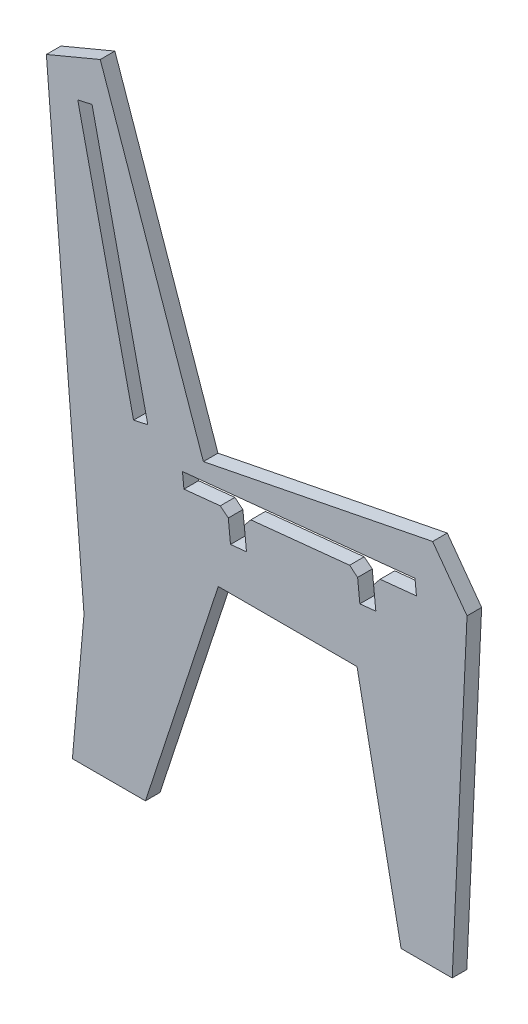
ISO-10303-21;
HEADER;
FILE_DESCRIPTION(('STEP AP214'),'2;1');
FILE_NAME('part.step','',(''),(''),'','','');
FILE_SCHEMA(('AUTOMOTIVE_DESIGN { 1 0 10303 214 1 1 1 1 }'));
ENDSEC;
DATA;
#1=APPLICATION_CONTEXT('core data for automotive mechanical design processes');
#2=APPLICATION_PROTOCOL_DEFINITION('international standard','automotive_design',2000,#1);
#3=PRODUCT_CONTEXT('',#1,'mechanical');
#4=PRODUCT('Part','Part','',(#3));
#5=PRODUCT_RELATED_PRODUCT_CATEGORY('part','',(#4));
#6=PRODUCT_DEFINITION_FORMATION('','',#4);
#7=PRODUCT_DEFINITION_CONTEXT('part definition',#1,'design');
#8=PRODUCT_DEFINITION('design','',#6,#7);
#9=PRODUCT_DEFINITION_SHAPE('','',#8);
#10=(LENGTH_UNIT() NAMED_UNIT(*) SI_UNIT(.MILLI.,.METRE.));
#11=(NAMED_UNIT(*) PLANE_ANGLE_UNIT() SI_UNIT($,.RADIAN.));
#12=(NAMED_UNIT(*) SI_UNIT($,.STERADIAN.) SOLID_ANGLE_UNIT());
#13=UNCERTAINTY_MEASURE_WITH_UNIT(LENGTH_MEASURE(1.E-05),#10,'distance_accuracy_value','');
#14=(GEOMETRIC_REPRESENTATION_CONTEXT(3) GLOBAL_UNCERTAINTY_ASSIGNED_CONTEXT((#13)) GLOBAL_UNIT_ASSIGNED_CONTEXT((#10,
#11,#12)) REPRESENTATION_CONTEXT('',''));
#15=CARTESIAN_POINT('',(0.,0.,0.));
#16=DIRECTION('',(0.,0.,1.));
#17=DIRECTION('',(1.,0.,0.));
#18=AXIS2_PLACEMENT_3D('',#15,#16,#17);
#19=CARTESIAN_POINT('',(152.712022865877,395.981549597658,20.));
#20=DIRECTION('',(-0.101741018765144,0.994810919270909,0.));
#21=DIRECTION('',(-0.994810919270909,-0.101741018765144,0.));
#22=AXIS2_PLACEMENT_3D('',#19,#20,#21);
#23=PLANE('',#22);
#24=DIRECTION('',(0.994810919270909,0.101741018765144,0.));
#25=VECTOR('',#24,1.);
#26=CARTESIAN_POINT('',(152.712022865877,395.981549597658,20.));
#27=LINE('',#26,#25);
#28=CARTESIAN_POINT('',(244.234627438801,405.341723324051,20.));
#29=VERTEX_POINT('',#28);
#30=CARTESIAN_POINT('',(379.528912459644,419.17850187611,20.));
#31=VERTEX_POINT('',#30);
#32=EDGE_CURVE('E308',#29,#31,#27,.T.);
#33=ORIENTED_EDGE('',*,*,#32,.T.);
#34=DIRECTION('',(0.,0.,-1.));
#35=VECTOR('',#34,1.);
#36=CARTESIAN_POINT('',(379.528912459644,419.17850187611,0.));
#37=LINE('',#36,#35);
#38=CARTESIAN_POINT('',(379.528912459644,419.17850187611,0.));
#39=VERTEX_POINT('',#38);
#40=EDGE_CURVE('E465',#31,#39,#37,.T.);
#41=ORIENTED_EDGE('',*,*,#40,.T.);
#42=DIRECTION('',(0.994810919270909,0.101741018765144,0.));
#43=VECTOR('',#42,1.);
#44=CARTESIAN_POINT('',(152.712022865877,395.981549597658,0.));
#45=LINE('',#44,#43);
#46=CARTESIAN_POINT('',(244.234627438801,405.341723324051,0.));
#47=VERTEX_POINT('',#46);
#48=EDGE_CURVE('E320',#47,#39,#45,.T.);
#49=ORIENTED_EDGE('',*,*,#48,.F.);
#50=DIRECTION('',(0.,0.,1.));
#51=VECTOR('',#50,1.);
#52=CARTESIAN_POINT('',(244.234627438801,405.341723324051,20.));
#53=LINE('',#52,#51);
#54=EDGE_CURVE('E462',#47,#29,#53,.T.);
#55=ORIENTED_EDGE('',*,*,#54,.T.);
#56=EDGE_LOOP('',(#33,#41,#49,#55));
#57=FACE_BOUND('',#56,.T.);
#58=ADVANCED_FACE('F33',(#57),#23,.T.);
#59=CARTESIAN_POINT('',(152.712022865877,395.981549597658,20.));
#60=VERTEX_POINT('',#59);
#61=CARTESIAN_POINT('',(202.452568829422,401.068600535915,20.));
#62=VERTEX_POINT('',#61);
#63=EDGE_CURVE('E304',#60,#62,#27,.T.);
#64=ORIENTED_EDGE('',*,*,#63,.T.);
#65=DIRECTION('',(0.,0.,-1.));
#66=VECTOR('',#65,1.);
#67=CARTESIAN_POINT('',(202.452568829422,401.068600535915,0.));
#68=LINE('',#67,#66);
#69=CARTESIAN_POINT('',(202.452568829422,401.068600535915,0.));
#70=VERTEX_POINT('',#69);
#71=EDGE_CURVE('E11',#62,#70,#68,.T.);
#72=ORIENTED_EDGE('',*,*,#71,.T.);
#73=CARTESIAN_POINT('',(152.712022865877,395.981549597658,0.));
#74=VERTEX_POINT('',#73);
#75=EDGE_CURVE('E317',#74,#70,#45,.T.);
#76=ORIENTED_EDGE('',*,*,#75,.F.);
#77=DIRECTION('',(0.,0.,-1.));
#78=VECTOR('',#77,1.);
#79=CARTESIAN_POINT('',(152.712022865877,395.981549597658,20.));
#80=LINE('',#79,#78);
#81=EDGE_CURVE('E332',#60,#74,#80,.T.);
#82=ORIENTED_EDGE('',*,*,#81,.F.);
#83=EDGE_LOOP('',(#64,#72,#76,#82));
#84=FACE_BOUND('',#83,.T.);
#85=ADVANCED_FACE('F539',(#84),#23,.T.);
#86=CARTESIAN_POINT('',(0.,0.,20.));
#87=DIRECTION('',(0.,0.,1.));
#88=DIRECTION('',(1.,0.,0.));
#89=AXIS2_PLACEMENT_3D('',#86,#87,#88);
#90=PLANE('',#89);
#91=DIRECTION('',(0.101741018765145,-0.994810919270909,0.));
#92=VECTOR('',#91,1.);
#93=CARTESIAN_POINT('',(389.477021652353,420.195912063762,20.));
#94=LINE('',#93,#92);
#95=CARTESIAN_POINT('',(390.494431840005,410.247802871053,20.));
#96=VERTEX_POINT('',#95);
#97=CARTESIAN_POINT('',(393.546662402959,380.403475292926,20.));
#98=VERTEX_POINT('',#97);
#99=EDGE_CURVE('E252',#96,#98,#94,.T.);
#100=ORIENTED_EDGE('',*,*,#99,.F.);
#101=DIRECTION('',(-0.775379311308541,0.631495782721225,0.));
#102=VECTOR('',#101,1.);
#103=CARTESIAN_POINT('',(356.601403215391,437.851459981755,20.));
#104=LINE('',#103,#102);
#105=EDGE_CURVE('E460',#96,#31,#104,.T.);
#106=ORIENTED_EDGE('',*,*,#105,.T.);
#107=ORIENTED_EDGE('',*,*,#32,.F.);
#108=DIRECTION('',(-0.631495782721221,-0.775379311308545,0.));
#109=VECTOR('',#108,1.);
#110=CARTESIAN_POINT('',(-51.6380225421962,42.0557951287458,20.));
#111=LINE('',#110,#109);
#112=CARTESIAN_POINT('',(235.303928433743,394.37620394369,20.));
#113=VERTEX_POINT('',#112);
#114=EDGE_CURVE('E456',#29,#113,#111,.T.);
#115=ORIENTED_EDGE('',*,*,#114,.T.);
#116=DIRECTION('',(-0.101741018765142,0.994810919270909,0.));
#117=VECTOR('',#116,1.);
#118=CARTESIAN_POINT('',(234.286518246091,404.324313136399,20.));
#119=LINE('',#118,#117);
#120=CARTESIAN_POINT('',(238.356158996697,364.531876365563,20.));
#121=VERTEX_POINT('',#120);
#122=EDGE_CURVE('E289',#121,#113,#119,.T.);
#123=ORIENTED_EDGE('',*,*,#122,.F.);
#124=DIRECTION('',(0.994810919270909,0.101741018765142,0.));
#125=VECTOR('',#124,1.);
#126=CARTESIAN_POINT('',(216.470318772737,362.29357395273,20.));
#127=LINE('',#126,#125);
#128=CARTESIAN_POINT('',(216.470318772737,362.29357395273,20.));
#129=VERTEX_POINT('',#128);
#130=EDGE_CURVE('E286',#129,#121,#127,.T.);
#131=ORIENTED_EDGE('',*,*,#130,.F.);
#132=DIRECTION('',(0.101741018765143,-0.994810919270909,0.));
#133=VECTOR('',#132,1.);
#134=CARTESIAN_POINT('',(212.400678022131,402.086010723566,20.));
#135=LINE('',#134,#133);
#136=CARTESIAN_POINT('',(213.418088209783,392.137901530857,20.));
#137=VERTEX_POINT('',#136);
#138=EDGE_CURVE('E284',#137,#129,#135,.T.);
#139=ORIENTED_EDGE('',*,*,#138,.F.);
#140=DIRECTION('',(-0.775379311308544,0.631495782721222,0.));
#141=VECTOR('',#140,1.);
#142=CARTESIAN_POINT('',(277.118182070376,340.258337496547,20.));
#143=LINE('',#142,#141);
#144=EDGE_CURVE('E454',#137,#62,#143,.T.);
#145=ORIENTED_EDGE('',*,*,#144,.T.);
#146=ORIENTED_EDGE('',*,*,#63,.F.);
#147=DIRECTION('',(0.101741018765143,-0.994810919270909,0.));
#148=VECTOR('',#147,1.);
#149=CARTESIAN_POINT('',(150.677202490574,415.877767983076,20.));
#150=LINE('',#149,#148);
#151=CARTESIAN_POINT('',(150.677202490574,415.877767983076,20.));
#152=VERTEX_POINT('',#151);
#153=EDGE_CURVE('E300',#152,#60,#150,.T.);
#154=ORIENTED_EDGE('',*,*,#153,.F.);
#155=DIRECTION('',(-0.994810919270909,-0.101741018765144,0.));
#156=VECTOR('',#155,1.);
#157=CARTESIAN_POINT('',(150.677202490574,415.877767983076,20.));
#158=LINE('',#157,#156);
#159=CARTESIAN_POINT('',(469.016696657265,448.434893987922,20.));
#160=VERTEX_POINT('',#159);
#161=EDGE_CURVE('E311',#160,#152,#158,.T.);
#162=ORIENTED_EDGE('',*,*,#161,.F.);
#163=DIRECTION('',(-0.101741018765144,0.994810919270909,0.));
#164=VECTOR('',#163,1.);
#165=CARTESIAN_POINT('',(469.016696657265,448.434893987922,20.));
#166=LINE('',#165,#164);
#167=CARTESIAN_POINT('',(471.051517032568,428.538675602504,20.));
#168=VERTEX_POINT('',#167);
#169=EDGE_CURVE('E307',#168,#160,#166,.T.);
#170=ORIENTED_EDGE('',*,*,#169,.F.);
#171=CARTESIAN_POINT('',(421.310971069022,423.451624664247,20.));
#172=VERTEX_POINT('',#171);
#173=EDGE_CURVE('E302',#172,#168,#27,.T.);
#174=ORIENTED_EDGE('',*,*,#173,.F.);
#175=DIRECTION('',(-0.631495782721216,-0.775379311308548,0.));
#176=VECTOR('',#175,1.);
#177=CARTESIAN_POINT('',(45.9550999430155,-37.427426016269,20.));
#178=LINE('',#177,#176);
#179=CARTESIAN_POINT('',(412.380272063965,412.486105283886,20.));
#180=VERTEX_POINT('',#179);
#181=EDGE_CURVE('E458',#172,#180,#178,.T.);
#182=ORIENTED_EDGE('',*,*,#181,.T.);
#183=DIRECTION('',(-0.101741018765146,0.994810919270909,0.));
#184=VECTOR('',#183,1.);
#185=CARTESIAN_POINT('',(411.362861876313,422.434214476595,20.));
#186=LINE('',#185,#184);
#187=CARTESIAN_POINT('',(415.432502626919,382.641777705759,20.));
#188=VERTEX_POINT('',#187);
#189=EDGE_CURVE('E257',#188,#180,#186,.T.);
#190=ORIENTED_EDGE('',*,*,#189,.F.);
#191=DIRECTION('',(0.994810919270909,0.101741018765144,0.));
#192=VECTOR('',#191,1.);
#193=CARTESIAN_POINT('',(393.546662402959,380.403475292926,20.));
#194=LINE('',#193,#192);
#195=EDGE_CURVE('E273',#98,#188,#194,.T.);
#196=ORIENTED_EDGE('',*,*,#195,.F.);
#197=EDGE_LOOP('',(#100,#106,#107,#115,#123,#131,#139,#145,#146,#154,#162,#170,#174,#182,#190,#196));
#198=FACE_BOUND('',#197,.T.);
#199=DIRECTION('',(0.218199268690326,-0.975904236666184,0.));
#200=VECTOR('',#199,1.);
#201=CARTESIAN_POINT('',(7.35353665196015,784.823616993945,20.));
#202=LINE('',#201,#200);
#203=CARTESIAN_POINT('',(7.35353665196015,784.823616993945,20.));
#204=VERTEX_POINT('',#203);
#205=CARTESIAN_POINT('',(83.7232806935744,443.257134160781,20.));
#206=VERTEX_POINT('',#205);
#207=EDGE_CURVE('E338',#204,#206,#202,.T.);
#208=ORIENTED_EDGE('',*,*,#207,.F.);
#209=DIRECTION('',(-0.975904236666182,-0.218199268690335,0.));
#210=VECTOR('',#209,1.);
#211=CARTESIAN_POINT('',(26.8716213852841,789.187602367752,20.));
#212=LINE('',#211,#210);
#213=CARTESIAN_POINT('',(26.8716213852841,789.187602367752,20.));
#214=VERTEX_POINT('',#213);
#215=EDGE_CURVE('E336',#214,#204,#212,.T.);
#216=ORIENTED_EDGE('',*,*,#215,.F.);
#217=DIRECTION('',(-0.218199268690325,0.975904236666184,0.));
#218=VECTOR('',#217,1.);
#219=CARTESIAN_POINT('',(26.8716213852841,789.187602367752,20.));
#220=LINE('',#219,#218);
#221=CARTESIAN_POINT('',(103.241365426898,447.621119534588,20.));
#222=VERTEX_POINT('',#221);
#223=EDGE_CURVE('E344',#222,#214,#220,.T.);
#224=ORIENTED_EDGE('',*,*,#223,.F.);
#225=DIRECTION('',(0.975904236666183,0.218199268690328,0.));
#226=VECTOR('',#225,1.);
#227=CARTESIAN_POINT('',(103.241365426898,447.621119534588,20.));
#228=LINE('',#227,#226);
#229=EDGE_CURVE('E341',#206,#222,#228,.T.);
#230=ORIENTED_EDGE('',*,*,#229,.F.);
#231=EDGE_LOOP('',(#208,#216,#224,#230));
#232=FACE_BOUND('',#231,.T.);
#233=DIRECTION('',(-0.0882487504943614,-0.996098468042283,0.));
#234=VECTOR('',#233,1.);
#235=CARTESIAN_POINT('',(15.8847750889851,179.297724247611,20.));
#236=LINE('',#235,#234);
#237=CARTESIAN_POINT('',(15.8847750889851,179.297724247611,20.));
#238=VERTEX_POINT('',#237);
#239=CARTESIAN_POINT('',(0.,0.,20.));
#240=VERTEX_POINT('',#239);
#241=EDGE_CURVE('E367',#238,#240,#236,.T.);
#242=ORIENTED_EDGE('',*,*,#241,.T.);
#243=DIRECTION('',(1.,0.,0.));
#244=VECTOR('',#243,1.);
#245=CARTESIAN_POINT('',(0.,0.,20.));
#246=LINE('',#245,#244);
#247=CARTESIAN_POINT('',(100.,0.,20.));
#248=VERTEX_POINT('',#247);
#249=EDGE_CURVE('E370',#240,#248,#246,.T.);
#250=ORIENTED_EDGE('',*,*,#249,.T.);
#251=DIRECTION('',(0.3115234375,0.950238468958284,0.));
#252=VECTOR('',#251,1.);
#253=CARTESIAN_POINT('',(100.,0.,20.));
#254=LINE('',#253,#252);
#255=CARTESIAN_POINT('',(199.6875,304.076310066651,20.));
#256=VERTEX_POINT('',#255);
#257=EDGE_CURVE('E373',#248,#256,#254,.T.);
#258=ORIENTED_EDGE('',*,*,#257,.T.);
#259=DIRECTION('',(1.,0.,0.));
#260=VECTOR('',#259,1.);
#261=CARTESIAN_POINT('',(199.6875,304.076310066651,20.));
#262=LINE('',#261,#260);
#263=CARTESIAN_POINT('',(389.6875,304.076310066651,20.));
#264=VERTEX_POINT('',#263);
#265=EDGE_CURVE('E375',#256,#264,#262,.T.);
#266=ORIENTED_EDGE('',*,*,#265,.T.);
#267=DIRECTION('',(0.194556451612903,-0.980891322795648,0.));
#268=VECTOR('',#267,1.);
#269=CARTESIAN_POINT('',(389.6875,304.076310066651,20.));
#270=LINE('',#269,#268);
#271=CARTESIAN_POINT('',(450.,0.,20.));
#272=VERTEX_POINT('',#271);
#273=EDGE_CURVE('E377',#264,#272,#270,.T.);
#274=ORIENTED_EDGE('',*,*,#273,.T.);
#275=DIRECTION('',(1.,0.,0.));
#276=VECTOR('',#275,1.);
#277=CARTESIAN_POINT('',(450.,0.,20.));
#278=LINE('',#277,#276);
#279=CARTESIAN_POINT('',(520.,0.,20.));
#280=VERTEX_POINT('',#279);
#281=EDGE_CURVE('E379',#272,#280,#278,.T.);
#282=ORIENTED_EDGE('',*,*,#281,.T.);
#283=DIRECTION('',(0.0461189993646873,0.998935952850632,0.));
#284=VECTOR('',#283,1.);
#285=CARTESIAN_POINT('',(520.,0.,20.));
#286=LINE('',#285,#284);
#287=CARTESIAN_POINT('',(540.292359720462,439.531819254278,20.));
#288=VERTEX_POINT('',#287);
#289=EDGE_CURVE('E381',#280,#288,#286,.T.);
#290=ORIENTED_EDGE('',*,*,#289,.T.);
#291=DIRECTION('',(-0.588583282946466,0.808436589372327,0.));
#292=VECTOR('',#291,1.);
#293=CARTESIAN_POINT('',(540.292359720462,439.531819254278,20.));
#294=LINE('',#293,#292);
#295=CARTESIAN_POINT('',(493.205697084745,504.206746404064,20.));
#296=VERTEX_POINT('',#295);
#297=EDGE_CURVE('E383',#288,#296,#294,.T.);
#298=ORIENTED_EDGE('',*,*,#297,.T.);
#299=DIRECTION('',(-0.980891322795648,-0.194556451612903,0.));
#300=VECTOR('',#299,1.);
#301=CARTESIAN_POINT('',(493.205697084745,504.206746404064,20.));
#302=LINE('',#301,#300);
#303=CARTESIAN_POINT('',(179.320473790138,441.948681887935,20.));
#304=VERTEX_POINT('',#303);
#305=EDGE_CURVE('E385',#296,#304,#302,.T.);
#306=ORIENTED_EDGE('',*,*,#305,.T.);
#307=DIRECTION('',(-0.328301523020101,0.944572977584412,0.));
#308=VECTOR('',#307,1.);
#309=CARTESIAN_POINT('',(179.320473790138,441.948681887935,20.));
#310=LINE('',#309,#308);
#311=CARTESIAN_POINT('',(38.1508188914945,848.115062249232,20.));
#312=VERTEX_POINT('',#311);
#313=EDGE_CURVE('E387',#304,#312,#310,.T.);
#314=ORIENTED_EDGE('',*,*,#313,.T.);
#315=DIRECTION('',(-0.922420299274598,-0.386187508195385,0.));
#316=VECTOR('',#315,1.);
#317=CARTESIAN_POINT('',(38.1508188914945,848.115062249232,20.));
#318=LINE('',#317,#316);
#319=CARTESIAN_POINT('',(-35.6428050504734,817.220061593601,20.));
#320=VERTEX_POINT('',#319);
#321=EDGE_CURVE('E389',#312,#320,#318,.T.);
#322=ORIENTED_EDGE('',*,*,#321,.T.);
#323=DIRECTION('',(0.0805118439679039,-0.99675365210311,0.));
#324=VECTOR('',#323,1.);
#325=CARTESIAN_POINT('',(-35.6428050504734,817.220061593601,20.));
#326=LINE('',#325,#324);
#327=EDGE_CURVE('E391',#320,#238,#326,.T.);
#328=ORIENTED_EDGE('',*,*,#327,.T.);
#329=EDGE_LOOP('',(#242,#250,#258,#266,#274,#282,#290,#298,#306,#314,#322,#328));
#330=FACE_BOUND('',#329,.T.);
#331=ADVANCED_FACE('F486',(#198,#232,#330),#90,.T.);
#332=CARTESIAN_POINT('',(0.,0.,0.));
#333=DIRECTION('',(0.,0.,1.));
#334=DIRECTION('',(1.,0.,0.));
#335=AXIS2_PLACEMENT_3D('',#332,#333,#334);
#336=PLANE('',#335);
#337=ORIENTED_EDGE('',*,*,#48,.T.);
#338=DIRECTION('',(0.775379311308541,-0.631495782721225,0.));
#339=VECTOR('',#338,1.);
#340=CARTESIAN_POINT('',(390.494431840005,410.247802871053,0.));
#341=LINE('',#340,#339);
#342=CARTESIAN_POINT('',(390.494431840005,410.247802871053,0.));
#343=VERTEX_POINT('',#342);
#344=EDGE_CURVE('E270',#39,#343,#341,.T.);
#345=ORIENTED_EDGE('',*,*,#344,.T.);
#346=DIRECTION('',(-0.101741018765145,0.994810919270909,0.));
#347=VECTOR('',#346,1.);
#348=CARTESIAN_POINT('',(389.477021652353,420.195912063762,0.));
#349=LINE('',#348,#347);
#350=CARTESIAN_POINT('',(393.546662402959,380.403475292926,0.));
#351=VERTEX_POINT('',#350);
#352=EDGE_CURVE('E249',#351,#343,#349,.T.);
#353=ORIENTED_EDGE('',*,*,#352,.F.);
#354=DIRECTION('',(-0.994810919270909,-0.101741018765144,0.));
#355=VECTOR('',#354,1.);
#356=CARTESIAN_POINT('',(393.546662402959,380.403475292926,0.));
#357=LINE('',#356,#355);
#358=CARTESIAN_POINT('',(415.432502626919,382.641777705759,0.));
#359=VERTEX_POINT('',#358);
#360=EDGE_CURVE('E261',#359,#351,#357,.T.);
#361=ORIENTED_EDGE('',*,*,#360,.F.);
#362=DIRECTION('',(0.101741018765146,-0.994810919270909,0.));
#363=VECTOR('',#362,1.);
#364=CARTESIAN_POINT('',(411.362861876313,422.434214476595,0.));
#365=LINE('',#364,#363);
#366=CARTESIAN_POINT('',(412.380272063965,412.486105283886,0.));
#367=VERTEX_POINT('',#366);
#368=EDGE_CURVE('E271',#367,#359,#365,.T.);
#369=ORIENTED_EDGE('',*,*,#368,.F.);
#370=DIRECTION('',(0.631495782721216,0.775379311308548,0.));
#371=VECTOR('',#370,1.);
#372=CARTESIAN_POINT('',(421.310971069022,423.451624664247,0.));
#373=LINE('',#372,#371);
#374=CARTESIAN_POINT('',(421.310971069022,423.451624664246,0.));
#375=VERTEX_POINT('',#374);
#376=EDGE_CURVE('E470',#367,#375,#373,.T.);
#377=ORIENTED_EDGE('',*,*,#376,.T.);
#378=CARTESIAN_POINT('',(471.051517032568,428.538675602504,0.));
#379=VERTEX_POINT('',#378);
#380=EDGE_CURVE('E316',#375,#379,#45,.T.);
#381=ORIENTED_EDGE('',*,*,#380,.T.);
#382=DIRECTION('',(-0.101741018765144,0.994810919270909,0.));
#383=VECTOR('',#382,1.);
#384=CARTESIAN_POINT('',(469.016696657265,448.434893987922,0.));
#385=LINE('',#384,#383);
#386=CARTESIAN_POINT('',(469.016696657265,448.434893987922,0.));
#387=VERTEX_POINT('',#386);
#388=EDGE_CURVE('E319',#379,#387,#385,.T.);
#389=ORIENTED_EDGE('',*,*,#388,.T.);
#390=DIRECTION('',(-0.994810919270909,-0.101741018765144,0.));
#391=VECTOR('',#390,1.);
#392=CARTESIAN_POINT('',(150.677202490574,415.877767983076,0.));
#393=LINE('',#392,#391);
#394=CARTESIAN_POINT('',(150.677202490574,415.877767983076,0.));
#395=VERTEX_POINT('',#394);
#396=EDGE_CURVE('E303',#387,#395,#393,.T.);
#397=ORIENTED_EDGE('',*,*,#396,.T.);
#398=DIRECTION('',(0.101741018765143,-0.994810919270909,0.));
#399=VECTOR('',#398,1.);
#400=CARTESIAN_POINT('',(150.677202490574,415.877767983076,0.));
#401=LINE('',#400,#399);
#402=EDGE_CURVE('E299',#395,#74,#401,.T.);
#403=ORIENTED_EDGE('',*,*,#402,.T.);
#404=ORIENTED_EDGE('',*,*,#75,.T.);
#405=DIRECTION('',(0.775379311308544,-0.631495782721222,0.));
#406=VECTOR('',#405,1.);
#407=CARTESIAN_POINT('',(213.418088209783,392.137901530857,0.));
#408=LINE('',#407,#406);
#409=CARTESIAN_POINT('',(213.418088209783,392.137901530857,0.));
#410=VERTEX_POINT('',#409);
#411=EDGE_CURVE('E56',#70,#410,#408,.T.);
#412=ORIENTED_EDGE('',*,*,#411,.T.);
#413=DIRECTION('',(-0.101741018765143,0.994810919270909,0.));
#414=VECTOR('',#413,1.);
#415=CARTESIAN_POINT('',(212.400678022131,402.086010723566,0.));
#416=LINE('',#415,#414);
#417=CARTESIAN_POINT('',(216.470318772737,362.29357395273,0.));
#418=VERTEX_POINT('',#417);
#419=EDGE_CURVE('E282',#418,#410,#416,.T.);
#420=ORIENTED_EDGE('',*,*,#419,.F.);
#421=DIRECTION('',(-0.994810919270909,-0.101741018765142,0.));
#422=VECTOR('',#421,1.);
#423=CARTESIAN_POINT('',(216.470318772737,362.29357395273,0.));
#424=LINE('',#423,#422);
#425=CARTESIAN_POINT('',(238.356158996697,364.531876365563,0.));
#426=VERTEX_POINT('',#425);
#427=EDGE_CURVE('E294',#426,#418,#424,.T.);
#428=ORIENTED_EDGE('',*,*,#427,.F.);
#429=DIRECTION('',(0.101741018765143,-0.994810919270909,0.));
#430=VECTOR('',#429,1.);
#431=CARTESIAN_POINT('',(234.286518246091,404.324313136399,0.));
#432=LINE('',#431,#430);
#433=CARTESIAN_POINT('',(235.303928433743,394.37620394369,0.));
#434=VERTEX_POINT('',#433);
#435=EDGE_CURVE('E264',#434,#426,#432,.T.);
#436=ORIENTED_EDGE('',*,*,#435,.F.);
#437=DIRECTION('',(0.631495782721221,0.775379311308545,0.));
#438=VECTOR('',#437,1.);
#439=CARTESIAN_POINT('',(244.234627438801,405.341723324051,0.));
#440=LINE('',#439,#438);
#441=EDGE_CURVE('E468',#434,#47,#440,.T.);
#442=ORIENTED_EDGE('',*,*,#441,.T.);
#443=EDGE_LOOP('',(#337,#345,#353,#361,#369,#377,#381,#389,#397,#403,#404,#412,#420,#428,#436,#442));
#444=FACE_BOUND('',#443,.T.);
#445=DIRECTION('',(-0.975904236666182,-0.218199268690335,0.));
#446=VECTOR('',#445,1.);
#447=CARTESIAN_POINT('',(26.8716213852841,789.187602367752,0.));
#448=LINE('',#447,#446);
#449=CARTESIAN_POINT('',(26.8716213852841,789.187602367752,0.));
#450=VERTEX_POINT('',#449);
#451=CARTESIAN_POINT('',(7.35353665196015,784.823616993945,0.));
#452=VERTEX_POINT('',#451);
#453=EDGE_CURVE('E335',#450,#452,#448,.T.);
#454=ORIENTED_EDGE('',*,*,#453,.T.);
#455=DIRECTION('',(0.218199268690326,-0.975904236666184,0.));
#456=VECTOR('',#455,1.);
#457=CARTESIAN_POINT('',(7.35353665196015,784.823616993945,0.));
#458=LINE('',#457,#456);
#459=CARTESIAN_POINT('',(83.7232806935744,443.257134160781,0.));
#460=VERTEX_POINT('',#459);
#461=EDGE_CURVE('E349',#452,#460,#458,.T.);
#462=ORIENTED_EDGE('',*,*,#461,.T.);
#463=DIRECTION('',(0.975904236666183,0.218199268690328,0.));
#464=VECTOR('',#463,1.);
#465=CARTESIAN_POINT('',(103.241365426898,447.621119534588,0.));
#466=LINE('',#465,#464);
#467=CARTESIAN_POINT('',(103.241365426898,447.621119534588,0.));
#468=VERTEX_POINT('',#467);
#469=EDGE_CURVE('E352',#460,#468,#466,.T.);
#470=ORIENTED_EDGE('',*,*,#469,.T.);
#471=DIRECTION('',(-0.218199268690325,0.975904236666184,0.));
#472=VECTOR('',#471,1.);
#473=CARTESIAN_POINT('',(26.8716213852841,789.187602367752,0.));
#474=LINE('',#473,#472);
#475=EDGE_CURVE('E339',#468,#450,#474,.T.);
#476=ORIENTED_EDGE('',*,*,#475,.T.);
#477=EDGE_LOOP('',(#454,#462,#470,#476));
#478=FACE_BOUND('',#477,.T.);
#479=DIRECTION('',(-0.0882487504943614,-0.996098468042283,0.));
#480=VECTOR('',#479,1.);
#481=CARTESIAN_POINT('',(15.8847750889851,179.297724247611,0.));
#482=LINE('',#481,#480);
#483=CARTESIAN_POINT('',(15.8847750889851,179.297724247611,0.));
#484=VERTEX_POINT('',#483);
#485=CARTESIAN_POINT('',(0.,0.,0.));
#486=VERTEX_POINT('',#485);
#487=EDGE_CURVE('E366',#484,#486,#482,.T.);
#488=ORIENTED_EDGE('',*,*,#487,.F.);
#489=DIRECTION('',(0.0805118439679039,-0.99675365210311,0.));
#490=VECTOR('',#489,1.);
#491=CARTESIAN_POINT('',(-35.6428050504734,817.220061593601,0.));
#492=LINE('',#491,#490);
#493=CARTESIAN_POINT('',(-35.6428050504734,817.220061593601,0.));
#494=VERTEX_POINT('',#493);
#495=EDGE_CURVE('E371',#494,#484,#492,.T.);
#496=ORIENTED_EDGE('',*,*,#495,.F.);
#497=DIRECTION('',(-0.922420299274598,-0.386187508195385,0.));
#498=VECTOR('',#497,1.);
#499=CARTESIAN_POINT('',(38.1508188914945,848.115062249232,0.));
#500=LINE('',#499,#498);
#501=CARTESIAN_POINT('',(38.1508188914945,848.115062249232,0.));
#502=VERTEX_POINT('',#501);
#503=EDGE_CURVE('E414',#502,#494,#500,.T.);
#504=ORIENTED_EDGE('',*,*,#503,.F.);
#505=DIRECTION('',(-0.328301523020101,0.944572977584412,0.));
#506=VECTOR('',#505,1.);
#507=CARTESIAN_POINT('',(179.320473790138,441.948681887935,0.));
#508=LINE('',#507,#506);
#509=CARTESIAN_POINT('',(179.320473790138,441.948681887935,0.));
#510=VERTEX_POINT('',#509);
#511=EDGE_CURVE('E412',#510,#502,#508,.T.);
#512=ORIENTED_EDGE('',*,*,#511,.F.);
#513=DIRECTION('',(-0.980891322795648,-0.194556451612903,0.));
#514=VECTOR('',#513,1.);
#515=CARTESIAN_POINT('',(493.205697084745,504.206746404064,0.));
#516=LINE('',#515,#514);
#517=CARTESIAN_POINT('',(493.205697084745,504.206746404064,0.));
#518=VERTEX_POINT('',#517);
#519=EDGE_CURVE('E410',#518,#510,#516,.T.);
#520=ORIENTED_EDGE('',*,*,#519,.F.);
#521=DIRECTION('',(-0.588583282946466,0.808436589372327,0.));
#522=VECTOR('',#521,1.);
#523=CARTESIAN_POINT('',(540.292359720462,439.531819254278,0.));
#524=LINE('',#523,#522);
#525=CARTESIAN_POINT('',(540.292359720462,439.531819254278,0.));
#526=VERTEX_POINT('',#525);
#527=EDGE_CURVE('E408',#526,#518,#524,.T.);
#528=ORIENTED_EDGE('',*,*,#527,.F.);
#529=DIRECTION('',(0.0461189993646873,0.998935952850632,0.));
#530=VECTOR('',#529,1.);
#531=CARTESIAN_POINT('',(520.,0.,0.));
#532=LINE('',#531,#530);
#533=CARTESIAN_POINT('',(520.,0.,0.));
#534=VERTEX_POINT('',#533);
#535=EDGE_CURVE('E406',#534,#526,#532,.T.);
#536=ORIENTED_EDGE('',*,*,#535,.F.);
#537=DIRECTION('',(1.,0.,0.));
#538=VECTOR('',#537,1.);
#539=CARTESIAN_POINT('',(450.,0.,0.));
#540=LINE('',#539,#538);
#541=CARTESIAN_POINT('',(450.,0.,0.));
#542=VERTEX_POINT('',#541);
#543=EDGE_CURVE('E404',#542,#534,#540,.T.);
#544=ORIENTED_EDGE('',*,*,#543,.F.);
#545=DIRECTION('',(0.194556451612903,-0.980891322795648,0.));
#546=VECTOR('',#545,1.);
#547=CARTESIAN_POINT('',(389.6875,304.076310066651,0.));
#548=LINE('',#547,#546);
#549=CARTESIAN_POINT('',(389.6875,304.076310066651,0.));
#550=VERTEX_POINT('',#549);
#551=EDGE_CURVE('E402',#550,#542,#548,.T.);
#552=ORIENTED_EDGE('',*,*,#551,.F.);
#553=DIRECTION('',(1.,0.,0.));
#554=VECTOR('',#553,1.);
#555=CARTESIAN_POINT('',(199.6875,304.076310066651,0.));
#556=LINE('',#555,#554);
#557=CARTESIAN_POINT('',(199.6875,304.076310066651,0.));
#558=VERTEX_POINT('',#557);
#559=EDGE_CURVE('E400',#558,#550,#556,.T.);
#560=ORIENTED_EDGE('',*,*,#559,.F.);
#561=DIRECTION('',(0.3115234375,0.950238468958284,0.));
#562=VECTOR('',#561,1.);
#563=CARTESIAN_POINT('',(100.,0.,0.));
#564=LINE('',#563,#562);
#565=CARTESIAN_POINT('',(100.,0.,0.));
#566=VERTEX_POINT('',#565);
#567=EDGE_CURVE('E398',#566,#558,#564,.T.);
#568=ORIENTED_EDGE('',*,*,#567,.F.);
#569=DIRECTION('',(1.,0.,0.));
#570=VECTOR('',#569,1.);
#571=CARTESIAN_POINT('',(0.,0.,0.));
#572=LINE('',#571,#570);
#573=EDGE_CURVE('E396',#486,#566,#572,.T.);
#574=ORIENTED_EDGE('',*,*,#573,.F.);
#575=EDGE_LOOP('',(#488,#496,#504,#512,#520,#528,#536,#544,#552,#560,#568,#574));
#576=FACE_BOUND('',#575,.T.);
#577=ADVANCED_FACE('F267',(#444,#478,#576),#336,.F.);
#578=CARTESIAN_POINT('',(15.8847750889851,179.297724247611,20.));
#579=DIRECTION('',(0.996098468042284,-0.0882487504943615,0.));
#580=DIRECTION('',(0.0882487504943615,0.996098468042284,0.));
#581=AXIS2_PLACEMENT_3D('',#578,#579,#580);
#582=PLANE('',#581);
#583=ORIENTED_EDGE('',*,*,#487,.T.);
#584=DIRECTION('',(0.,0.,-1.));
#585=VECTOR('',#584,1.);
#586=CARTESIAN_POINT('',(0.,0.,20.));
#587=LINE('',#586,#585);
#588=EDGE_CURVE('E449',#240,#486,#587,.T.);
#589=ORIENTED_EDGE('',*,*,#588,.F.);
#590=ORIENTED_EDGE('',*,*,#241,.F.);
#591=DIRECTION('',(0.,0.,-1.));
#592=VECTOR('',#591,1.);
#593=CARTESIAN_POINT('',(15.8847750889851,179.297724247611,20.));
#594=LINE('',#593,#592);
#595=EDGE_CURVE('E393',#238,#484,#594,.T.);
#596=ORIENTED_EDGE('',*,*,#595,.T.);
#597=EDGE_LOOP('',(#583,#589,#590,#596));
#598=FACE_BOUND('',#597,.T.);
#599=ADVANCED_FACE('F576',(#598),#582,.F.);
#600=CARTESIAN_POINT('',(0.,0.,20.));
#601=DIRECTION('',(0.,1.,0.));
#602=DIRECTION('',(0.,0.,1.));
#603=AXIS2_PLACEMENT_3D('',#600,#601,#602);
#604=PLANE('',#603);
#605=ORIENTED_EDGE('',*,*,#573,.T.);
#606=DIRECTION('',(0.,0.,-1.));
#607=VECTOR('',#606,1.);
#608=CARTESIAN_POINT('',(100.,0.,20.));
#609=LINE('',#608,#607);
#610=EDGE_CURVE('E446',#248,#566,#609,.T.);
#611=ORIENTED_EDGE('',*,*,#610,.F.);
#612=ORIENTED_EDGE('',*,*,#249,.F.);
#613=ORIENTED_EDGE('',*,*,#588,.T.);
#614=EDGE_LOOP('',(#605,#611,#612,#613));
#615=FACE_BOUND('',#614,.T.);
#616=ADVANCED_FACE('F615',(#615),#604,.F.);
#617=CARTESIAN_POINT('',(100.,0.,20.));
#618=DIRECTION('',(-0.950238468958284,0.3115234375,0.));
#619=DIRECTION('',(-0.3115234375,-0.950238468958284,0.));
#620=AXIS2_PLACEMENT_3D('',#617,#618,#619);
#621=PLANE('',#620);
#622=ORIENTED_EDGE('',*,*,#567,.T.);
#623=DIRECTION('',(0.,0.,-1.));
#624=VECTOR('',#623,1.);
#625=CARTESIAN_POINT('',(199.6875,304.076310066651,20.));
#626=LINE('',#625,#624);
#627=EDGE_CURVE('E443',#256,#558,#626,.T.);
#628=ORIENTED_EDGE('',*,*,#627,.F.);
#629=ORIENTED_EDGE('',*,*,#257,.F.);
#630=ORIENTED_EDGE('',*,*,#610,.T.);
#631=EDGE_LOOP('',(#622,#628,#629,#630));
#632=FACE_BOUND('',#631,.T.);
#633=ADVANCED_FACE('F611',(#632),#621,.F.);
#634=CARTESIAN_POINT('',(199.6875,304.076310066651,20.));
#635=DIRECTION('',(0.,1.,0.));
#636=DIRECTION('',(0.,0.,1.));
#637=AXIS2_PLACEMENT_3D('',#634,#635,#636);
#638=PLANE('',#637);
#639=ORIENTED_EDGE('',*,*,#559,.T.);
#640=DIRECTION('',(0.,0.,-1.));
#641=VECTOR('',#640,1.);
#642=CARTESIAN_POINT('',(389.6875,304.076310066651,20.));
#643=LINE('',#642,#641);
#644=EDGE_CURVE('E440',#264,#550,#643,.T.);
#645=ORIENTED_EDGE('',*,*,#644,.F.);
#646=ORIENTED_EDGE('',*,*,#265,.F.);
#647=ORIENTED_EDGE('',*,*,#627,.T.);
#648=EDGE_LOOP('',(#639,#645,#646,#647));
#649=FACE_BOUND('',#648,.T.);
#650=ADVANCED_FACE('F607',(#649),#638,.F.);
#651=CARTESIAN_POINT('',(389.6875,304.076310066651,20.));
#652=DIRECTION('',(0.980891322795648,0.194556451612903,0.));
#653=DIRECTION('',(-0.194556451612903,0.980891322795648,0.));
#654=AXIS2_PLACEMENT_3D('',#651,#652,#653);
#655=PLANE('',#654);
#656=ORIENTED_EDGE('',*,*,#551,.T.);
#657=DIRECTION('',(0.,0.,-1.));
#658=VECTOR('',#657,1.);
#659=CARTESIAN_POINT('',(450.,0.,20.));
#660=LINE('',#659,#658);
#661=EDGE_CURVE('E437',#272,#542,#660,.T.);
#662=ORIENTED_EDGE('',*,*,#661,.F.);
#663=ORIENTED_EDGE('',*,*,#273,.F.);
#664=ORIENTED_EDGE('',*,*,#644,.T.);
#665=EDGE_LOOP('',(#656,#662,#663,#664));
#666=FACE_BOUND('',#665,.T.);
#667=ADVANCED_FACE('F603',(#666),#655,.F.);
#668=CARTESIAN_POINT('',(450.,0.,20.));
#669=DIRECTION('',(0.,1.,0.));
#670=DIRECTION('',(0.,0.,1.));
#671=AXIS2_PLACEMENT_3D('',#668,#669,#670);
#672=PLANE('',#671);
#673=ORIENTED_EDGE('',*,*,#543,.T.);
#674=DIRECTION('',(0.,0.,-1.));
#675=VECTOR('',#674,1.);
#676=CARTESIAN_POINT('',(520.,0.,20.));
#677=LINE('',#676,#675);
#678=EDGE_CURVE('E434',#280,#534,#677,.T.);
#679=ORIENTED_EDGE('',*,*,#678,.F.);
#680=ORIENTED_EDGE('',*,*,#281,.F.);
#681=ORIENTED_EDGE('',*,*,#661,.T.);
#682=EDGE_LOOP('',(#673,#679,#680,#681));
#683=FACE_BOUND('',#682,.T.);
#684=ADVANCED_FACE('F599',(#683),#672,.F.);
#685=CARTESIAN_POINT('',(520.,0.,20.));
#686=DIRECTION('',(-0.998935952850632,0.0461189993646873,0.));
#687=DIRECTION('',(-0.0461189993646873,-0.998935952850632,0.));
#688=AXIS2_PLACEMENT_3D('',#685,#686,#687);
#689=PLANE('',#688);
#690=ORIENTED_EDGE('',*,*,#535,.T.);
#691=DIRECTION('',(0.,0.,-1.));
#692=VECTOR('',#691,1.);
#693=CARTESIAN_POINT('',(540.292359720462,439.531819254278,20.));
#694=LINE('',#693,#692);
#695=EDGE_CURVE('E431',#288,#526,#694,.T.);
#696=ORIENTED_EDGE('',*,*,#695,.F.);
#697=ORIENTED_EDGE('',*,*,#289,.F.);
#698=ORIENTED_EDGE('',*,*,#678,.T.);
#699=EDGE_LOOP('',(#690,#696,#697,#698));
#700=FACE_BOUND('',#699,.T.);
#701=ADVANCED_FACE('F595',(#700),#689,.F.);
#702=CARTESIAN_POINT('',(540.292359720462,439.531819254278,20.));
#703=DIRECTION('',(-0.808436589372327,-0.588583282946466,0.));
#704=DIRECTION('',(0.588583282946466,-0.808436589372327,0.));
#705=AXIS2_PLACEMENT_3D('',#702,#703,#704);
#706=PLANE('',#705);
#707=ORIENTED_EDGE('',*,*,#527,.T.);
#708=DIRECTION('',(0.,0.,-1.));
#709=VECTOR('',#708,1.);
#710=CARTESIAN_POINT('',(493.205697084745,504.206746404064,20.));
#711=LINE('',#710,#709);
#712=EDGE_CURVE('E428',#296,#518,#711,.T.);
#713=ORIENTED_EDGE('',*,*,#712,.F.);
#714=ORIENTED_EDGE('',*,*,#297,.F.);
#715=ORIENTED_EDGE('',*,*,#695,.T.);
#716=EDGE_LOOP('',(#707,#713,#714,#715));
#717=FACE_BOUND('',#716,.T.);
#718=ADVANCED_FACE('F591',(#717),#706,.F.);
#719=CARTESIAN_POINT('',(493.205697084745,504.206746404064,20.));
#720=DIRECTION('',(0.194556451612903,-0.980891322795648,0.));
#721=DIRECTION('',(0.980891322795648,0.194556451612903,0.));
#722=AXIS2_PLACEMENT_3D('',#719,#720,#721);
#723=PLANE('',#722);
#724=ORIENTED_EDGE('',*,*,#519,.T.);
#725=DIRECTION('',(0.,0.,-1.));
#726=VECTOR('',#725,1.);
#727=CARTESIAN_POINT('',(179.320473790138,441.948681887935,20.));
#728=LINE('',#727,#726);
#729=EDGE_CURVE('E425',#304,#510,#728,.T.);
#730=ORIENTED_EDGE('',*,*,#729,.F.);
#731=ORIENTED_EDGE('',*,*,#305,.F.);
#732=ORIENTED_EDGE('',*,*,#712,.T.);
#733=EDGE_LOOP('',(#724,#730,#731,#732));
#734=FACE_BOUND('',#733,.T.);
#735=ADVANCED_FACE('F587',(#734),#723,.F.);
#736=CARTESIAN_POINT('',(179.320473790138,441.948681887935,20.));
#737=DIRECTION('',(-0.944572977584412,-0.328301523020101,0.));
#738=DIRECTION('',(0.328301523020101,-0.944572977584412,0.));
#739=AXIS2_PLACEMENT_3D('',#736,#737,#738);
#740=PLANE('',#739);
#741=ORIENTED_EDGE('',*,*,#511,.T.);
#742=DIRECTION('',(0.,0.,-1.));
#743=VECTOR('',#742,1.);
#744=CARTESIAN_POINT('',(38.1508188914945,848.115062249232,20.));
#745=LINE('',#744,#743);
#746=EDGE_CURVE('E422',#312,#502,#745,.T.);
#747=ORIENTED_EDGE('',*,*,#746,.F.);
#748=ORIENTED_EDGE('',*,*,#313,.F.);
#749=ORIENTED_EDGE('',*,*,#729,.T.);
#750=EDGE_LOOP('',(#741,#747,#748,#749));
#751=FACE_BOUND('',#750,.T.);
#752=ADVANCED_FACE('F583',(#751),#740,.F.);
#753=CARTESIAN_POINT('',(38.1508188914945,848.115062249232,20.));
#754=DIRECTION('',(0.386187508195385,-0.922420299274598,0.));
#755=DIRECTION('',(0.922420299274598,0.386187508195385,0.));
#756=AXIS2_PLACEMENT_3D('',#753,#754,#755);
#757=PLANE('',#756);
#758=ORIENTED_EDGE('',*,*,#503,.T.);
#759=DIRECTION('',(0.,0.,-1.));
#760=VECTOR('',#759,1.);
#761=CARTESIAN_POINT('',(-35.6428050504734,817.220061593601,20.));
#762=LINE('',#761,#760);
#763=EDGE_CURVE('E419',#320,#494,#762,.T.);
#764=ORIENTED_EDGE('',*,*,#763,.F.);
#765=ORIENTED_EDGE('',*,*,#321,.F.);
#766=ORIENTED_EDGE('',*,*,#746,.T.);
#767=EDGE_LOOP('',(#758,#764,#765,#766));
#768=FACE_BOUND('',#767,.T.);
#769=ADVANCED_FACE('F579',(#768),#757,.F.);
#770=CARTESIAN_POINT('',(-35.6428050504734,817.220061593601,20.));
#771=DIRECTION('',(0.99675365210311,0.0805118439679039,0.));
#772=DIRECTION('',(-0.0805118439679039,0.99675365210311,0.));
#773=AXIS2_PLACEMENT_3D('',#770,#771,#772);
#774=PLANE('',#773);
#775=ORIENTED_EDGE('',*,*,#495,.T.);
#776=ORIENTED_EDGE('',*,*,#595,.F.);
#777=ORIENTED_EDGE('',*,*,#327,.F.);
#778=ORIENTED_EDGE('',*,*,#763,.T.);
#779=EDGE_LOOP('',(#775,#776,#777,#778));
#780=FACE_BOUND('',#779,.T.);
#781=ADVANCED_FACE('F570',(#780),#774,.F.);
#782=CARTESIAN_POINT('',(26.8716213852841,789.187602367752,20.));
#783=DIRECTION('',(0.218199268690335,-0.975904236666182,0.));
#784=DIRECTION('',(0.975904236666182,0.218199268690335,0.));
#785=AXIS2_PLACEMENT_3D('',#782,#783,#784);
#786=PLANE('',#785);
#787=ORIENTED_EDGE('',*,*,#453,.F.);
#788=DIRECTION('',(0.,0.,-1.));
#789=VECTOR('',#788,1.);
#790=CARTESIAN_POINT('',(26.8716213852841,789.187602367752,20.));
#791=LINE('',#790,#789);
#792=EDGE_CURVE('E346',#214,#450,#791,.T.);
#793=ORIENTED_EDGE('',*,*,#792,.F.);
#794=ORIENTED_EDGE('',*,*,#215,.T.);
#795=DIRECTION('',(0.,0.,-1.));
#796=VECTOR('',#795,1.);
#797=CARTESIAN_POINT('',(7.35353665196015,784.823616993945,20.));
#798=LINE('',#797,#796);
#799=EDGE_CURVE('E363',#204,#452,#798,.T.);
#800=ORIENTED_EDGE('',*,*,#799,.T.);
#801=EDGE_LOOP('',(#787,#793,#794,#800));
#802=FACE_BOUND('',#801,.T.);
#803=ADVANCED_FACE('F566',(#802),#786,.T.);
#804=CARTESIAN_POINT('',(7.35353665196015,784.823616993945,20.));
#805=DIRECTION('',(0.975904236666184,0.218199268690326,0.));
#806=DIRECTION('',(-0.218199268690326,0.975904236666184,0.));
#807=AXIS2_PLACEMENT_3D('',#804,#805,#806);
#808=PLANE('',#807);
#809=ORIENTED_EDGE('',*,*,#461,.F.);
#810=ORIENTED_EDGE('',*,*,#799,.F.);
#811=ORIENTED_EDGE('',*,*,#207,.T.);
#812=DIRECTION('',(0.,0.,-1.));
#813=VECTOR('',#812,1.);
#814=CARTESIAN_POINT('',(83.7232806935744,443.257134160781,20.));
#815=LINE('',#814,#813);
#816=EDGE_CURVE('E361',#206,#460,#815,.T.);
#817=ORIENTED_EDGE('',*,*,#816,.T.);
#818=EDGE_LOOP('',(#809,#810,#811,#817));
#819=FACE_BOUND('',#818,.T.);
#820=ADVANCED_FACE('F562',(#819),#808,.T.);
#821=CARTESIAN_POINT('',(103.241365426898,447.621119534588,20.));
#822=DIRECTION('',(-0.218199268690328,0.975904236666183,0.));
#823=DIRECTION('',(-0.975904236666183,-0.218199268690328,0.));
#824=AXIS2_PLACEMENT_3D('',#821,#822,#823);
#825=PLANE('',#824);
#826=ORIENTED_EDGE('',*,*,#469,.F.);
#827=ORIENTED_EDGE('',*,*,#816,.F.);
#828=ORIENTED_EDGE('',*,*,#229,.T.);
#829=DIRECTION('',(0.,0.,-1.));
#830=VECTOR('',#829,1.);
#831=CARTESIAN_POINT('',(103.241365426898,447.621119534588,20.));
#832=LINE('',#831,#830);
#833=EDGE_CURVE('E359',#222,#468,#832,.T.);
#834=ORIENTED_EDGE('',*,*,#833,.T.);
#835=EDGE_LOOP('',(#826,#827,#828,#834));
#836=FACE_BOUND('',#835,.T.);
#837=ADVANCED_FACE('F556',(#836),#825,.T.);
#838=CARTESIAN_POINT('',(26.8716213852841,789.187602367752,20.));
#839=DIRECTION('',(-0.975904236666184,-0.218199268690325,0.));
#840=DIRECTION('',(0.218199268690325,-0.975904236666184,0.));
#841=AXIS2_PLACEMENT_3D('',#838,#839,#840);
#842=PLANE('',#841);
#843=ORIENTED_EDGE('',*,*,#475,.F.);
#844=ORIENTED_EDGE('',*,*,#833,.F.);
#845=ORIENTED_EDGE('',*,*,#223,.T.);
#846=ORIENTED_EDGE('',*,*,#792,.T.);
#847=EDGE_LOOP('',(#843,#844,#845,#846));
#848=FACE_BOUND('',#847,.T.);
#849=ADVANCED_FACE('F552',(#848),#842,.T.);
#850=CARTESIAN_POINT('',(150.677202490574,415.877767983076,20.));
#851=DIRECTION('',(0.994810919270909,0.101741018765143,0.));
#852=DIRECTION('',(-0.101741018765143,0.994810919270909,0.));
#853=AXIS2_PLACEMENT_3D('',#850,#851,#852);
#854=PLANE('',#853);
#855=ORIENTED_EDGE('',*,*,#402,.F.);
#856=DIRECTION('',(0.,0.,-1.));
#857=VECTOR('',#856,1.);
#858=CARTESIAN_POINT('',(150.677202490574,415.877767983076,20.));
#859=LINE('',#858,#857);
#860=EDGE_CURVE('E313',#152,#395,#859,.T.);
#861=ORIENTED_EDGE('',*,*,#860,.F.);
#862=ORIENTED_EDGE('',*,*,#153,.T.);
#863=ORIENTED_EDGE('',*,*,#81,.T.);
#864=EDGE_LOOP('',(#855,#861,#862,#863));
#865=FACE_BOUND('',#864,.T.);
#866=ADVANCED_FACE('F520',(#865),#854,.T.);
#867=ORIENTED_EDGE('',*,*,#380,.F.);
#868=DIRECTION('',(0.,0.,1.));
#869=VECTOR('',#868,1.);
#870=CARTESIAN_POINT('',(421.310971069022,423.451624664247,20.));
#871=LINE('',#870,#869);
#872=EDGE_CURVE('E473',#375,#172,#871,.T.);
#873=ORIENTED_EDGE('',*,*,#872,.T.);
#874=ORIENTED_EDGE('',*,*,#173,.T.);
#875=DIRECTION('',(0.,0.,-1.));
#876=VECTOR('',#875,1.);
#877=CARTESIAN_POINT('',(471.051517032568,428.538675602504,20.));
#878=LINE('',#877,#876);
#879=EDGE_CURVE('E329',#168,#379,#878,.T.);
#880=ORIENTED_EDGE('',*,*,#879,.T.);
#881=EDGE_LOOP('',(#867,#873,#874,#880));
#882=FACE_BOUND('',#881,.T.);
#883=ADVANCED_FACE('F507',(#882),#23,.T.);
#884=CARTESIAN_POINT('',(469.016696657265,448.434893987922,20.));
#885=DIRECTION('',(-0.994810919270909,-0.101741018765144,0.));
#886=DIRECTION('',(0.101741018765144,-0.994810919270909,0.));
#887=AXIS2_PLACEMENT_3D('',#884,#885,#886);
#888=PLANE('',#887);
#889=ORIENTED_EDGE('',*,*,#388,.F.);
#890=ORIENTED_EDGE('',*,*,#879,.F.);
#891=ORIENTED_EDGE('',*,*,#169,.T.);
#892=DIRECTION('',(0.,0.,-1.));
#893=VECTOR('',#892,1.);
#894=CARTESIAN_POINT('',(469.016696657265,448.434893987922,20.));
#895=LINE('',#894,#893);
#896=EDGE_CURVE('E327',#160,#387,#895,.T.);
#897=ORIENTED_EDGE('',*,*,#896,.T.);
#898=EDGE_LOOP('',(#889,#890,#891,#897));
#899=FACE_BOUND('',#898,.T.);
#900=ADVANCED_FACE('F512',(#899),#888,.T.);
#901=CARTESIAN_POINT('',(150.677202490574,415.877767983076,20.));
#902=DIRECTION('',(0.101741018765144,-0.994810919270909,0.));
#903=DIRECTION('',(0.994810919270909,0.101741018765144,0.));
#904=AXIS2_PLACEMENT_3D('',#901,#902,#903);
#905=PLANE('',#904);
#906=ORIENTED_EDGE('',*,*,#396,.F.);
#907=ORIENTED_EDGE('',*,*,#896,.F.);
#908=ORIENTED_EDGE('',*,*,#161,.T.);
#909=ORIENTED_EDGE('',*,*,#860,.T.);
#910=EDGE_LOOP('',(#906,#907,#908,#909));
#911=FACE_BOUND('',#910,.T.);
#912=ADVANCED_FACE('F518',(#911),#905,.T.);
#913=CARTESIAN_POINT('',(212.400678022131,402.086010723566,-0.001000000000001));
#914=DIRECTION('',(-0.994810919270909,-0.101741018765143,0.));
#915=DIRECTION('',(0.101741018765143,-0.994810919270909,0.));
#916=AXIS2_PLACEMENT_3D('',#913,#914,#915);
#917=PLANE('',#916);
#918=ORIENTED_EDGE('',*,*,#419,.T.);
#919=DIRECTION('',(0.,0.,1.));
#920=VECTOR('',#919,1.);
#921=CARTESIAN_POINT('',(213.418088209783,392.137901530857,20.));
#922=LINE('',#921,#920);
#923=EDGE_CURVE('E41',#410,#137,#922,.T.);
#924=ORIENTED_EDGE('',*,*,#923,.T.);
#925=ORIENTED_EDGE('',*,*,#138,.T.);
#926=DIRECTION('',(0.,0.,1.));
#927=VECTOR('',#926,1.);
#928=CARTESIAN_POINT('',(216.470318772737,362.29357395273,-0.001000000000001));
#929=LINE('',#928,#927);
#930=EDGE_CURVE('E291',#418,#129,#929,.T.);
#931=ORIENTED_EDGE('',*,*,#930,.F.);
#932=EDGE_LOOP('',(#918,#924,#925,#931));
#933=FACE_BOUND('',#932,.T.);
#934=ADVANCED_FACE('F482',(#933),#917,.F.);
#935=CARTESIAN_POINT('',(234.286518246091,404.324313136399,-0.001000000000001));
#936=DIRECTION('',(0.994810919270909,0.101741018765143,0.));
#937=DIRECTION('',(-0.101741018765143,0.994810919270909,0.));
#938=AXIS2_PLACEMENT_3D('',#935,#936,#937);
#939=PLANE('',#938);
#940=ORIENTED_EDGE('',*,*,#122,.T.);
#941=DIRECTION('',(0.,0.,-1.));
#942=VECTOR('',#941,1.);
#943=CARTESIAN_POINT('',(235.303928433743,394.37620394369,0.));
#944=LINE('',#943,#942);
#945=EDGE_CURVE('E48',#113,#434,#944,.T.);
#946=ORIENTED_EDGE('',*,*,#945,.T.);
#947=ORIENTED_EDGE('',*,*,#435,.T.);
#948=DIRECTION('',(0.,0.,1.));
#949=VECTOR('',#948,1.);
#950=CARTESIAN_POINT('',(238.356158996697,364.531876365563,-0.001000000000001));
#951=LINE('',#950,#949);
#952=EDGE_CURVE('E292',#426,#121,#951,.T.);
#953=ORIENTED_EDGE('',*,*,#952,.T.);
#954=EDGE_LOOP('',(#940,#946,#947,#953));
#955=FACE_BOUND('',#954,.T.);
#956=ADVANCED_FACE('F752',(#955),#939,.F.);
#957=CARTESIAN_POINT('',(216.470318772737,362.29357395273,-0.001000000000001));
#958=DIRECTION('',(0.101741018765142,-0.994810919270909,0.));
#959=DIRECTION('',(0.994810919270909,0.101741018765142,0.));
#960=AXIS2_PLACEMENT_3D('',#957,#958,#959);
#961=PLANE('',#960);
#962=ORIENTED_EDGE('',*,*,#427,.T.);
#963=ORIENTED_EDGE('',*,*,#930,.T.);
#964=ORIENTED_EDGE('',*,*,#130,.T.);
#965=ORIENTED_EDGE('',*,*,#952,.F.);
#966=EDGE_LOOP('',(#962,#963,#964,#965));
#967=FACE_BOUND('',#966,.T.);
#968=ADVANCED_FACE('F492',(#967),#961,.F.);
#969=CARTESIAN_POINT('',(389.477021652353,420.195912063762,-0.001000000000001));
#970=DIRECTION('',(-0.994810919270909,-0.101741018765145,0.));
#971=DIRECTION('',(0.101741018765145,-0.994810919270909,0.));
#972=AXIS2_PLACEMENT_3D('',#969,#970,#971);
#973=PLANE('',#972);
#974=ORIENTED_EDGE('',*,*,#352,.T.);
#975=DIRECTION('',(0.,0.,1.));
#976=VECTOR('',#975,1.);
#977=CARTESIAN_POINT('',(390.494431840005,410.247802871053,20.));
#978=LINE('',#977,#976);
#979=EDGE_CURVE('E452',#343,#96,#978,.T.);
#980=ORIENTED_EDGE('',*,*,#979,.T.);
#981=ORIENTED_EDGE('',*,*,#99,.T.);
#982=DIRECTION('',(0.,0.,1.));
#983=VECTOR('',#982,1.);
#984=CARTESIAN_POINT('',(393.546662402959,380.403475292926,-0.001000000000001));
#985=LINE('',#984,#983);
#986=EDGE_CURVE('E244',#351,#98,#985,.T.);
#987=ORIENTED_EDGE('',*,*,#986,.F.);
#988=EDGE_LOOP('',(#974,#980,#981,#987));
#989=FACE_BOUND('',#988,.T.);
#990=ADVANCED_FACE('F246',(#989),#973,.F.);
#991=CARTESIAN_POINT('',(411.362861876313,422.434214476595,-0.001000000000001));
#992=DIRECTION('',(0.994810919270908,0.101741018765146,0.));
#993=DIRECTION('',(-0.101741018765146,0.994810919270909,0.));
#994=AXIS2_PLACEMENT_3D('',#991,#992,#993);
#995=PLANE('',#994);
#996=ORIENTED_EDGE('',*,*,#189,.T.);
#997=DIRECTION('',(0.,0.,-1.));
#998=VECTOR('',#997,1.);
#999=CARTESIAN_POINT('',(412.380272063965,412.486105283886,0.));
#1000=LINE('',#999,#998);
#1001=EDGE_CURVE('E476',#180,#367,#1000,.T.);
#1002=ORIENTED_EDGE('',*,*,#1001,.T.);
#1003=ORIENTED_EDGE('',*,*,#368,.T.);
#1004=DIRECTION('',(0.,0.,1.));
#1005=VECTOR('',#1004,1.);
#1006=CARTESIAN_POINT('',(415.432502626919,382.641777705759,-0.001000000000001));
#1007=LINE('',#1006,#1005);
#1008=EDGE_CURVE('E256',#359,#188,#1007,.T.);
#1009=ORIENTED_EDGE('',*,*,#1008,.T.);
#1010=EDGE_LOOP('',(#996,#1002,#1003,#1009));
#1011=FACE_BOUND('',#1010,.T.);
#1012=ADVANCED_FACE('F528',(#1011),#995,.F.);
#1013=CARTESIAN_POINT('',(393.546662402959,380.403475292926,-0.001000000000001));
#1014=DIRECTION('',(0.101741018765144,-0.994810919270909,0.));
#1015=DIRECTION('',(0.994810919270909,0.101741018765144,0.));
#1016=AXIS2_PLACEMENT_3D('',#1013,#1014,#1015);
#1017=PLANE('',#1016);
#1018=ORIENTED_EDGE('',*,*,#360,.T.);
#1019=ORIENTED_EDGE('',*,*,#986,.T.);
#1020=ORIENTED_EDGE('',*,*,#195,.T.);
#1021=ORIENTED_EDGE('',*,*,#1008,.F.);
#1022=EDGE_LOOP('',(#1018,#1019,#1020,#1021));
#1023=FACE_BOUND('',#1022,.T.);
#1024=ADVANCED_FACE('F262',(#1023),#1017,.F.);
#1025=CARTESIAN_POINT('',(390.494431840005,410.247802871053,-0.001000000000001));
#1026=DIRECTION('',(0.631495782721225,0.775379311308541,0.));
#1027=DIRECTION('',(0.,0.,-1.));
#1028=AXIS2_PLACEMENT_3D('',#1025,#1026,#1027);
#1029=PLANE('',#1028);
#1030=ORIENTED_EDGE('',*,*,#344,.F.);
#1031=ORIENTED_EDGE('',*,*,#40,.F.);
#1032=ORIENTED_EDGE('',*,*,#105,.F.);
#1033=ORIENTED_EDGE('',*,*,#979,.F.);
#1034=EDGE_LOOP('',(#1030,#1031,#1032,#1033));
#1035=FACE_BOUND('',#1034,.T.);
#1036=ADVANCED_FACE('F524',(#1035),#1029,.T.);
#1037=CARTESIAN_POINT('',(421.310971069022,423.451624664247,20.));
#1038=DIRECTION('',(-0.775379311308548,0.631495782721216,0.));
#1039=DIRECTION('',(0.,0.,-1.));
#1040=AXIS2_PLACEMENT_3D('',#1037,#1038,#1039);
#1041=PLANE('',#1040);
#1042=ORIENTED_EDGE('',*,*,#376,.F.);
#1043=ORIENTED_EDGE('',*,*,#1001,.F.);
#1044=ORIENTED_EDGE('',*,*,#181,.F.);
#1045=ORIENTED_EDGE('',*,*,#872,.F.);
#1046=EDGE_LOOP('',(#1042,#1043,#1044,#1045));
#1047=FACE_BOUND('',#1046,.T.);
#1048=ADVANCED_FACE('F530',(#1047),#1041,.T.);
#1049=CARTESIAN_POINT('',(244.234627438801,405.341723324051,20.));
#1050=DIRECTION('',(-0.775379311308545,0.63149578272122,0.));
#1051=DIRECTION('',(0.,0.,-1.));
#1052=AXIS2_PLACEMENT_3D('',#1049,#1050,#1051);
#1053=PLANE('',#1052);
#1054=ORIENTED_EDGE('',*,*,#441,.F.);
#1055=ORIENTED_EDGE('',*,*,#945,.F.);
#1056=ORIENTED_EDGE('',*,*,#114,.F.);
#1057=ORIENTED_EDGE('',*,*,#54,.F.);
#1058=EDGE_LOOP('',(#1054,#1055,#1056,#1057));
#1059=FACE_BOUND('',#1058,.T.);
#1060=ADVANCED_FACE('F498',(#1059),#1053,.T.);
#1061=CARTESIAN_POINT('',(213.418088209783,392.137901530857,-0.001000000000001));
#1062=DIRECTION('',(0.631495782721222,0.775379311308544,0.));
#1063=DIRECTION('',(0.,0.,-1.));
#1064=AXIS2_PLACEMENT_3D('',#1061,#1062,#1063);
#1065=PLANE('',#1064);
#1066=ORIENTED_EDGE('',*,*,#411,.F.);
#1067=ORIENTED_EDGE('',*,*,#71,.F.);
#1068=ORIENTED_EDGE('',*,*,#144,.F.);
#1069=ORIENTED_EDGE('',*,*,#923,.F.);
#1070=EDGE_LOOP('',(#1066,#1067,#1068,#1069));
#1071=FACE_BOUND('',#1070,.T.);
#1072=ADVANCED_FACE('F35',(#1071),#1065,.T.);
#1073=CLOSED_SHELL('',(#58,#85,#331,#577,#599,#616,#633,#650,#667,#684,#701,#718,#735,#752,#769,
#781,#803,#820,#837,#849,#866,#883,#900,#912,#934,#956,#968,#990,#1012,#1024,#1036,#1048,#1060,#1072));
#1074=MANIFOLD_SOLID_BREP('B2',#1073);
#1075=ADVANCED_BREP_SHAPE_REPRESENTATION('',(#18,#1074),#14);
#1076=SHAPE_DEFINITION_REPRESENTATION(#9,#1075);
ENDSEC;
END-ISO-10303-21;
